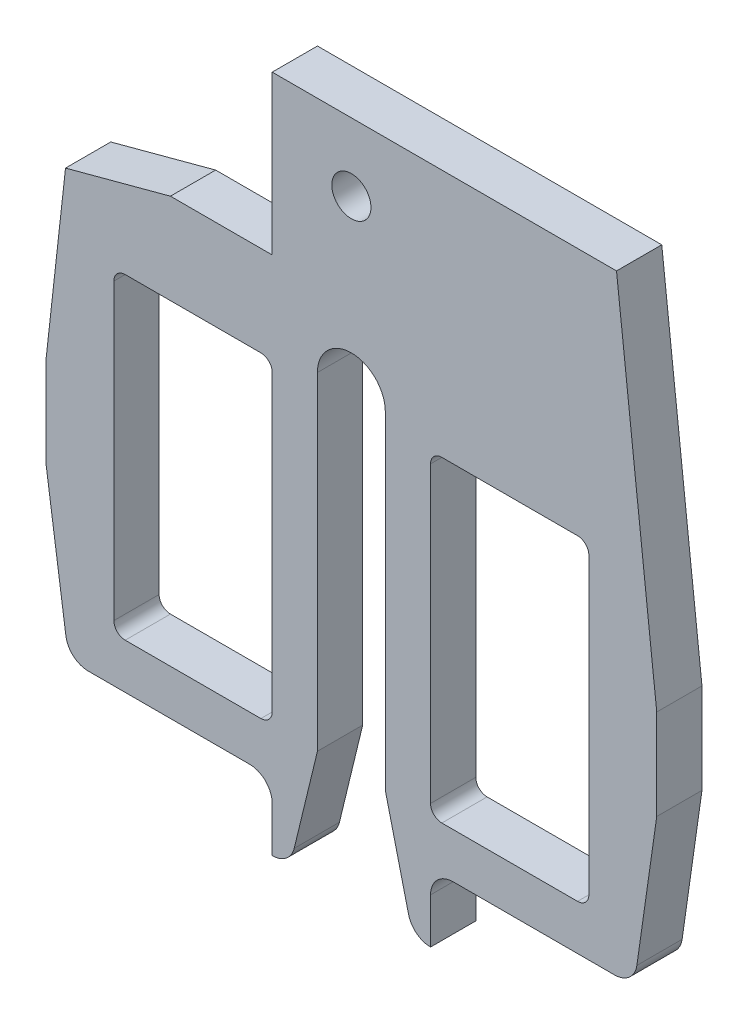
ISO-10303-21;
HEADER;
FILE_DESCRIPTION(('STEP AP214'),'2;1');
FILE_NAME('part.step','',(''),(''),'','','');
FILE_SCHEMA(('AUTOMOTIVE_DESIGN { 1 0 10303 214 1 1 1 1 }'));
ENDSEC;
DATA;
#1=APPLICATION_CONTEXT('core data for automotive mechanical design processes');
#2=APPLICATION_PROTOCOL_DEFINITION('international standard','automotive_design',2000,#1);
#3=PRODUCT_CONTEXT('',#1,'mechanical');
#4=PRODUCT('Part','Part','',(#3));
#5=PRODUCT_RELATED_PRODUCT_CATEGORY('part','',(#4));
#6=PRODUCT_DEFINITION_FORMATION('','',#4);
#7=PRODUCT_DEFINITION_CONTEXT('part definition',#1,'design');
#8=PRODUCT_DEFINITION('design','',#6,#7);
#9=PRODUCT_DEFINITION_SHAPE('','',#8);
#10=(LENGTH_UNIT() NAMED_UNIT(*) SI_UNIT(.MILLI.,.METRE.));
#11=(NAMED_UNIT(*) PLANE_ANGLE_UNIT() SI_UNIT($,.RADIAN.));
#12=(NAMED_UNIT(*) SI_UNIT($,.STERADIAN.) SOLID_ANGLE_UNIT());
#13=UNCERTAINTY_MEASURE_WITH_UNIT(LENGTH_MEASURE(1.E-05),#10,'distance_accuracy_value','');
#14=(GEOMETRIC_REPRESENTATION_CONTEXT(3) GLOBAL_UNCERTAINTY_ASSIGNED_CONTEXT((#13)) GLOBAL_UNIT_ASSIGNED_CONTEXT((#10,
#11,#12)) REPRESENTATION_CONTEXT('',''));
#15=CARTESIAN_POINT('',(0.,0.,0.));
#16=DIRECTION('',(0.,0.,1.));
#17=DIRECTION('',(1.,0.,0.));
#18=AXIS2_PLACEMENT_3D('',#15,#16,#17);
#19=CARTESIAN_POINT('',(-11.6327,-29.0855785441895,0.));
#20=DIRECTION('',(0.,0.,1.));
#21=DIRECTION('',(1.,0.,0.));
#22=AXIS2_PLACEMENT_3D('',#19,#20,#21);
#23=CYLINDRICAL_SURFACE('',#22,0.999999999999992);
#24=CARTESIAN_POINT('',(-11.6327,-29.0855785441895,-1.));
#25=DIRECTION('',(0.,0.,1.));
#26=DIRECTION('',(1.,0.,0.));
#27=AXIS2_PLACEMENT_3D('',#24,#25,#26);
#28=CIRCLE('',#27,0.999999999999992);
#29=CARTESIAN_POINT('',(-12.6226493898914,-29.2270006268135,-1.));
#30=VERTEX_POINT('',#29);
#31=CARTESIAN_POINT('',(-11.6327,-30.0855785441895,-1.));
#32=VERTEX_POINT('',#31);
#33=EDGE_CURVE('E19',#30,#32,#28,.T.);
#34=ORIENTED_EDGE('',*,*,#33,.T.);
#35=DIRECTION('',(0.,0.,-1.));
#36=VECTOR('',#35,1.);
#37=CARTESIAN_POINT('',(-11.6327,-30.0855785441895,0.));
#38=LINE('',#37,#36);
#39=CARTESIAN_POINT('',(-11.6327,-30.0855785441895,1.));
#40=VERTEX_POINT('',#39);
#41=EDGE_CURVE('E267',#40,#32,#38,.T.);
#42=ORIENTED_EDGE('',*,*,#41,.F.);
#43=CARTESIAN_POINT('',(-11.6327,-29.0855785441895,1.));
#44=DIRECTION('',(0.,0.,1.));
#45=DIRECTION('',(1.,0.,0.));
#46=AXIS2_PLACEMENT_3D('',#43,#44,#45);
#47=CIRCLE('',#46,0.999999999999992);
#48=CARTESIAN_POINT('',(-12.6226493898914,-29.2270006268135,1.));
#49=VERTEX_POINT('',#48);
#50=EDGE_CURVE('E263',#49,#40,#47,.T.);
#51=ORIENTED_EDGE('',*,*,#50,.F.);
#52=DIRECTION('',(0.,0.,1.));
#53=VECTOR('',#52,1.);
#54=CARTESIAN_POINT('',(-12.6226493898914,-29.2270006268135,0.));
#55=LINE('',#54,#53);
#56=EDGE_CURVE('E265',#30,#49,#55,.T.);
#57=ORIENTED_EDGE('',*,*,#56,.F.);
#58=EDGE_LOOP('',(#34,#42,#51,#57));
#59=FACE_BOUND('',#58,.T.);
#60=ADVANCED_FACE('F16',(#59),#23,.T.);
#61=CARTESIAN_POINT('',(-4.5,-31.0855785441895,0.));
#62=DIRECTION('',(0.,0.,1.));
#63=DIRECTION('',(1.,0.,0.));
#64=AXIS2_PLACEMENT_3D('',#61,#62,#63);
#65=CYLINDRICAL_SURFACE('',#64,1.00000000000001);
#66=DIRECTION('',(0.,0.,-1.));
#67=VECTOR('',#66,1.);
#68=CARTESIAN_POINT('',(-4.5,-30.0855785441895,0.));
#69=LINE('',#68,#67);
#70=CARTESIAN_POINT('',(-4.5,-30.0855785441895,-1.));
#71=VERTEX_POINT('',#70);
#72=CARTESIAN_POINT('',(-4.5,-30.0855785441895,1.));
#73=VERTEX_POINT('',#72);
#74=EDGE_CURVE('E372',#71,#73,#69,.F.);
#75=ORIENTED_EDGE('',*,*,#74,.F.);
#76=CARTESIAN_POINT('',(-4.5,-31.0855785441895,-1.));
#77=DIRECTION('',(0.,0.,1.));
#78=DIRECTION('',(1.,0.,0.));
#79=AXIS2_PLACEMENT_3D('',#76,#77,#78);
#80=CIRCLE('',#79,1.00000000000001);
#81=CARTESIAN_POINT('',(-3.5,-31.0855785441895,-1.));
#82=VERTEX_POINT('',#81);
#83=EDGE_CURVE('E364',#82,#71,#80,.T.);
#84=ORIENTED_EDGE('',*,*,#83,.F.);
#85=DIRECTION('',(0.,0.,1.));
#86=VECTOR('',#85,1.);
#87=CARTESIAN_POINT('',(-3.5,-31.0855785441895,0.));
#88=LINE('',#87,#86);
#89=CARTESIAN_POINT('',(-3.5,-31.0855785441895,1.));
#90=VERTEX_POINT('',#89);
#91=EDGE_CURVE('E486',#90,#82,#88,.F.);
#92=ORIENTED_EDGE('',*,*,#91,.F.);
#93=CARTESIAN_POINT('',(-4.5,-31.0855785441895,1.));
#94=DIRECTION('',(0.,0.,1.));
#95=DIRECTION('',(1.,0.,0.));
#96=AXIS2_PLACEMENT_3D('',#93,#94,#95);
#97=CIRCLE('',#96,1.00000000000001);
#98=EDGE_CURVE('E272',#73,#90,#97,.F.);
#99=ORIENTED_EDGE('',*,*,#98,.F.);
#100=EDGE_LOOP('',(#75,#84,#92,#99));
#101=FACE_BOUND('',#100,.T.);
#102=ADVANCED_FACE('F565',(#101),#65,.F.);
#103=CARTESIAN_POINT('',(-3.5,-32.0855785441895,0.));
#104=DIRECTION('',(0.,0.,1.));
#105=DIRECTION('',(1.,0.,0.));
#106=AXIS2_PLACEMENT_3D('',#103,#104,#105);
#107=CYLINDRICAL_SURFACE('',#106,1.);
#108=CARTESIAN_POINT('',(-3.5,-32.0855785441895,-1.));
#109=DIRECTION('',(0.,0.,1.));
#110=DIRECTION('',(1.,0.,0.));
#111=AXIS2_PLACEMENT_3D('',#108,#109,#110);
#112=CIRCLE('',#111,1.);
#113=CARTESIAN_POINT('',(-3.5,-33.0855785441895,-1.));
#114=VERTEX_POINT('',#113);
#115=CARTESIAN_POINT('',(-2.52822021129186,-32.3214684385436,-1.));
#116=VERTEX_POINT('',#115);
#117=EDGE_CURVE('E363',#114,#116,#112,.T.);
#118=ORIENTED_EDGE('',*,*,#117,.T.);
#119=DIRECTION('',(0.,0.,1.));
#120=VECTOR('',#119,1.);
#121=CARTESIAN_POINT('',(-2.52822021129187,-32.3214684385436,0.));
#122=LINE('',#121,#120);
#123=CARTESIAN_POINT('',(-2.52822021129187,-32.3214684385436,1.));
#124=VERTEX_POINT('',#123);
#125=EDGE_CURVE('E482',#124,#116,#122,.F.);
#126=ORIENTED_EDGE('',*,*,#125,.F.);
#127=CARTESIAN_POINT('',(-3.5,-32.0855785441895,1.));
#128=DIRECTION('',(0.,0.,1.));
#129=DIRECTION('',(1.,0.,0.));
#130=AXIS2_PLACEMENT_3D('',#127,#128,#129);
#131=CIRCLE('',#130,1.);
#132=CARTESIAN_POINT('',(-3.5,-33.0855785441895,1.));
#133=VERTEX_POINT('',#132);
#134=EDGE_CURVE('E339',#133,#124,#131,.T.);
#135=ORIENTED_EDGE('',*,*,#134,.F.);
#136=DIRECTION('',(0.,0.,1.));
#137=VECTOR('',#136,1.);
#138=CARTESIAN_POINT('',(-3.5,-33.0855785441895,0.));
#139=LINE('',#138,#137);
#140=EDGE_CURVE('E489',#114,#133,#139,.T.);
#141=ORIENTED_EDGE('',*,*,#140,.F.);
#142=EDGE_LOOP('',(#118,#126,#135,#141));
#143=FACE_BOUND('',#142,.T.);
#144=ADVANCED_FACE('F567',(#143),#107,.T.);
#145=CARTESIAN_POINT('',(3.5,-32.0855785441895,0.));
#146=DIRECTION('',(0.,0.,1.));
#147=DIRECTION('',(1.,0.,0.));
#148=AXIS2_PLACEMENT_3D('',#145,#146,#147);
#149=CYLINDRICAL_SURFACE('',#148,1.);
#150=CARTESIAN_POINT('',(3.5,-32.0855785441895,-1.));
#151=DIRECTION('',(0.,0.,1.));
#152=DIRECTION('',(1.,0.,0.));
#153=AXIS2_PLACEMENT_3D('',#150,#151,#152);
#154=CIRCLE('',#153,1.);
#155=CARTESIAN_POINT('',(2.52822021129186,-32.3214684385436,-1.));
#156=VERTEX_POINT('',#155);
#157=CARTESIAN_POINT('',(3.5,-33.0855785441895,-1.));
#158=VERTEX_POINT('',#157);
#159=EDGE_CURVE('E361',#156,#158,#154,.T.);
#160=ORIENTED_EDGE('',*,*,#159,.T.);
#161=DIRECTION('',(0.,0.,-1.));
#162=VECTOR('',#161,1.);
#163=CARTESIAN_POINT('',(3.5,-33.0855785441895,0.));
#164=LINE('',#163,#162);
#165=CARTESIAN_POINT('',(3.5,-33.0855785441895,1.));
#166=VERTEX_POINT('',#165);
#167=EDGE_CURVE('E460',#166,#158,#164,.T.);
#168=ORIENTED_EDGE('',*,*,#167,.F.);
#169=CARTESIAN_POINT('',(3.5,-32.0855785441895,1.));
#170=DIRECTION('',(0.,0.,1.));
#171=DIRECTION('',(1.,0.,0.));
#172=AXIS2_PLACEMENT_3D('',#169,#170,#171);
#173=CIRCLE('',#172,1.);
#174=CARTESIAN_POINT('',(2.52822021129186,-32.3214684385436,1.));
#175=VERTEX_POINT('',#174);
#176=EDGE_CURVE('E337',#175,#166,#173,.T.);
#177=ORIENTED_EDGE('',*,*,#176,.F.);
#178=DIRECTION('',(0.,0.,1.));
#179=VECTOR('',#178,1.);
#180=CARTESIAN_POINT('',(2.52822021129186,-32.3214684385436,0.));
#181=LINE('',#180,#179);
#182=EDGE_CURVE('E467',#156,#175,#181,.T.);
#183=ORIENTED_EDGE('',*,*,#182,.F.);
#184=EDGE_LOOP('',(#160,#168,#177,#183));
#185=FACE_BOUND('',#184,.T.);
#186=ADVANCED_FACE('F573',(#185),#149,.T.);
#187=CARTESIAN_POINT('',(4.5,-31.0855785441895,0.));
#188=DIRECTION('',(0.,0.,1.));
#189=DIRECTION('',(1.,0.,0.));
#190=AXIS2_PLACEMENT_3D('',#187,#188,#189);
#191=CYLINDRICAL_SURFACE('',#190,1.00000000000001);
#192=DIRECTION('',(0.,0.,-1.));
#193=VECTOR('',#192,1.);
#194=CARTESIAN_POINT('',(3.5,-31.0855785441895,0.));
#195=LINE('',#194,#193);
#196=CARTESIAN_POINT('',(3.5,-31.0855785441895,-1.));
#197=VERTEX_POINT('',#196);
#198=CARTESIAN_POINT('',(3.5,-31.0855785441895,1.));
#199=VERTEX_POINT('',#198);
#200=EDGE_CURVE('E463',#197,#199,#195,.F.);
#201=ORIENTED_EDGE('',*,*,#200,.F.);
#202=CARTESIAN_POINT('',(4.5,-31.0855785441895,-1.));
#203=DIRECTION('',(0.,0.,1.));
#204=DIRECTION('',(1.,0.,0.));
#205=AXIS2_PLACEMENT_3D('',#202,#203,#204);
#206=CIRCLE('',#205,1.00000000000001);
#207=CARTESIAN_POINT('',(4.5,-30.0855785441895,-1.));
#208=VERTEX_POINT('',#207);
#209=EDGE_CURVE('E359',#208,#197,#206,.T.);
#210=ORIENTED_EDGE('',*,*,#209,.F.);
#211=DIRECTION('',(0.,0.,-1.));
#212=VECTOR('',#211,1.);
#213=CARTESIAN_POINT('',(4.5,-30.0855785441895,0.));
#214=LINE('',#213,#212);
#215=CARTESIAN_POINT('',(4.5,-30.0855785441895,1.));
#216=VERTEX_POINT('',#215);
#217=EDGE_CURVE('E453',#216,#208,#214,.T.);
#218=ORIENTED_EDGE('',*,*,#217,.F.);
#219=CARTESIAN_POINT('',(4.5,-31.0855785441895,1.));
#220=DIRECTION('',(0.,0.,1.));
#221=DIRECTION('',(1.,0.,0.));
#222=AXIS2_PLACEMENT_3D('',#219,#220,#221);
#223=CIRCLE('',#222,1.00000000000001);
#224=EDGE_CURVE('E335',#199,#216,#223,.F.);
#225=ORIENTED_EDGE('',*,*,#224,.F.);
#226=EDGE_LOOP('',(#201,#210,#218,#225));
#227=FACE_BOUND('',#226,.T.);
#228=ADVANCED_FACE('F727',(#227),#191,.F.);
#229=CARTESIAN_POINT('',(11.6327,-29.0855785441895,0.));
#230=DIRECTION('',(0.,0.,1.));
#231=DIRECTION('',(1.,0.,0.));
#232=AXIS2_PLACEMENT_3D('',#229,#230,#231);
#233=CYLINDRICAL_SURFACE('',#232,0.999999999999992);
#234=CARTESIAN_POINT('',(11.6327,-29.0855785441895,-1.));
#235=DIRECTION('',(0.,0.,1.));
#236=DIRECTION('',(1.,0.,0.));
#237=AXIS2_PLACEMENT_3D('',#234,#235,#236);
#238=CIRCLE('',#237,0.999999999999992);
#239=CARTESIAN_POINT('',(11.6327,-30.0855785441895,-1.));
#240=VERTEX_POINT('',#239);
#241=CARTESIAN_POINT('',(12.6226493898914,-29.2270006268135,-1.));
#242=VERTEX_POINT('',#241);
#243=EDGE_CURVE('E357',#240,#242,#238,.T.);
#244=ORIENTED_EDGE('',*,*,#243,.T.);
#245=DIRECTION('',(0.,0.,1.));
#246=VECTOR('',#245,1.);
#247=CARTESIAN_POINT('',(12.6226493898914,-29.2270006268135,0.));
#248=LINE('',#247,#246);
#249=CARTESIAN_POINT('',(12.6226493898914,-29.2270006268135,1.));
#250=VERTEX_POINT('',#249);
#251=EDGE_CURVE('E439',#250,#242,#248,.F.);
#252=ORIENTED_EDGE('',*,*,#251,.F.);
#253=CARTESIAN_POINT('',(11.6327,-29.0855785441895,1.));
#254=DIRECTION('',(0.,0.,1.));
#255=DIRECTION('',(1.,0.,0.));
#256=AXIS2_PLACEMENT_3D('',#253,#254,#255);
#257=CIRCLE('',#256,0.999999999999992);
#258=CARTESIAN_POINT('',(11.6327,-30.0855785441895,1.));
#259=VERTEX_POINT('',#258);
#260=EDGE_CURVE('E333',#259,#250,#257,.T.);
#261=ORIENTED_EDGE('',*,*,#260,.F.);
#262=DIRECTION('',(0.,0.,-1.));
#263=VECTOR('',#262,1.);
#264=CARTESIAN_POINT('',(11.6327,-30.0855785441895,0.));
#265=LINE('',#264,#263);
#266=EDGE_CURVE('E456',#240,#259,#265,.F.);
#267=ORIENTED_EDGE('',*,*,#266,.F.);
#268=EDGE_LOOP('',(#244,#252,#261,#267));
#269=FACE_BOUND('',#268,.T.);
#270=ADVANCED_FACE('F723',(#269),#233,.T.);
#271=CARTESIAN_POINT('',(4.,-14.5855785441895,0.));
#272=DIRECTION('',(0.,0.,1.));
#273=DIRECTION('',(1.,0.,0.));
#274=AXIS2_PLACEMENT_3D('',#271,#272,#273);
#275=CYLINDRICAL_SURFACE('',#274,0.500000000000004);
#276=DIRECTION('',(0.,0.,1.));
#277=VECTOR('',#276,1.);
#278=CARTESIAN_POINT('',(3.5,-14.5855785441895,0.));
#279=LINE('',#278,#277);
#280=CARTESIAN_POINT('',(3.5,-14.5855785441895,1.));
#281=VERTEX_POINT('',#280);
#282=CARTESIAN_POINT('',(3.5,-14.5855785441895,-1.));
#283=VERTEX_POINT('',#282);
#284=EDGE_CURVE('E435',#281,#283,#279,.F.);
#285=ORIENTED_EDGE('',*,*,#284,.T.);
#286=CARTESIAN_POINT('',(4.,-14.5855785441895,-1.));
#287=DIRECTION('',(0.,0.,1.));
#288=DIRECTION('',(1.,0.,0.));
#289=AXIS2_PLACEMENT_3D('',#286,#287,#288);
#290=CIRCLE('',#289,0.500000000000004);
#291=CARTESIAN_POINT('',(4.,-14.0855785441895,-1.));
#292=VERTEX_POINT('',#291);
#293=EDGE_CURVE('E355',#292,#283,#290,.T.);
#294=ORIENTED_EDGE('',*,*,#293,.F.);
#295=DIRECTION('',(0.,0.,1.));
#296=VECTOR('',#295,1.);
#297=CARTESIAN_POINT('',(4.,-14.0855785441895,0.));
#298=LINE('',#297,#296);
#299=CARTESIAN_POINT('',(4.,-14.0855785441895,1.));
#300=VERTEX_POINT('',#299);
#301=EDGE_CURVE('E425',#292,#300,#298,.T.);
#302=ORIENTED_EDGE('',*,*,#301,.T.);
#303=CARTESIAN_POINT('',(4.,-14.5855785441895,1.));
#304=DIRECTION('',(0.,0.,1.));
#305=DIRECTION('',(1.,0.,0.));
#306=AXIS2_PLACEMENT_3D('',#303,#304,#305);
#307=CIRCLE('',#306,0.500000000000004);
#308=EDGE_CURVE('E329',#281,#300,#307,.F.);
#309=ORIENTED_EDGE('',*,*,#308,.F.);
#310=EDGE_LOOP('',(#285,#294,#302,#309));
#311=FACE_BOUND('',#310,.T.);
#312=ADVANCED_FACE('F719',(#311),#275,.F.);
#313=CARTESIAN_POINT('',(10.,-14.5855785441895,0.));
#314=DIRECTION('',(0.,0.,1.));
#315=DIRECTION('',(1.,0.,0.));
#316=AXIS2_PLACEMENT_3D('',#313,#314,#315);
#317=CYLINDRICAL_SURFACE('',#316,0.500000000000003);
#318=DIRECTION('',(0.,0.,1.));
#319=VECTOR('',#318,1.);
#320=CARTESIAN_POINT('',(10.,-14.0855785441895,0.));
#321=LINE('',#320,#319);
#322=CARTESIAN_POINT('',(10.,-14.0855785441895,1.));
#323=VERTEX_POINT('',#322);
#324=CARTESIAN_POINT('',(10.,-14.0855785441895,-1.));
#325=VERTEX_POINT('',#324);
#326=EDGE_CURVE('E428',#323,#325,#321,.F.);
#327=ORIENTED_EDGE('',*,*,#326,.T.);
#328=CARTESIAN_POINT('',(10.,-14.5855785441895,-1.));
#329=DIRECTION('',(0.,0.,1.));
#330=DIRECTION('',(1.,0.,0.));
#331=AXIS2_PLACEMENT_3D('',#328,#329,#330);
#332=CIRCLE('',#331,0.500000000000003);
#333=CARTESIAN_POINT('',(10.5,-14.5855785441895,-1.));
#334=VERTEX_POINT('',#333);
#335=EDGE_CURVE('E353',#334,#325,#332,.T.);
#336=ORIENTED_EDGE('',*,*,#335,.F.);
#337=DIRECTION('',(0.,0.,-1.));
#338=VECTOR('',#337,1.);
#339=CARTESIAN_POINT('',(10.5,-14.5855785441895,0.));
#340=LINE('',#339,#338);
#341=CARTESIAN_POINT('',(10.5,-14.5855785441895,1.));
#342=VERTEX_POINT('',#341);
#343=EDGE_CURVE('E418',#334,#342,#340,.F.);
#344=ORIENTED_EDGE('',*,*,#343,.T.);
#345=CARTESIAN_POINT('',(10.,-14.5855785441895,1.));
#346=DIRECTION('',(0.,0.,1.));
#347=DIRECTION('',(1.,0.,0.));
#348=AXIS2_PLACEMENT_3D('',#345,#346,#347);
#349=CIRCLE('',#348,0.500000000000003);
#350=EDGE_CURVE('E327',#323,#342,#349,.F.);
#351=ORIENTED_EDGE('',*,*,#350,.F.);
#352=EDGE_LOOP('',(#327,#336,#344,#351));
#353=FACE_BOUND('',#352,.T.);
#354=ADVANCED_FACE('F715',(#353),#317,.F.);
#355=CARTESIAN_POINT('',(4.,-27.5855785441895,0.));
#356=DIRECTION('',(0.,0.,1.));
#357=DIRECTION('',(1.,0.,0.));
#358=AXIS2_PLACEMENT_3D('',#355,#356,#357);
#359=CYLINDRICAL_SURFACE('',#358,0.499999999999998);
#360=DIRECTION('',(0.,0.,-1.));
#361=VECTOR('',#360,1.);
#362=CARTESIAN_POINT('',(4.,-28.0855785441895,0.));
#363=LINE('',#362,#361);
#364=CARTESIAN_POINT('',(4.,-28.0855785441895,1.));
#365=VERTEX_POINT('',#364);
#366=CARTESIAN_POINT('',(4.,-28.0855785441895,-1.));
#367=VERTEX_POINT('',#366);
#368=EDGE_CURVE('E414',#365,#367,#363,.T.);
#369=ORIENTED_EDGE('',*,*,#368,.T.);
#370=CARTESIAN_POINT('',(4.,-27.5855785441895,-1.));
#371=DIRECTION('',(0.,0.,1.));
#372=DIRECTION('',(1.,0.,0.));
#373=AXIS2_PLACEMENT_3D('',#370,#371,#372);
#374=CIRCLE('',#373,0.499999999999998);
#375=CARTESIAN_POINT('',(3.5,-27.5855785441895,-1.));
#376=VERTEX_POINT('',#375);
#377=EDGE_CURVE('E351',#376,#367,#374,.T.);
#378=ORIENTED_EDGE('',*,*,#377,.F.);
#379=DIRECTION('',(0.,0.,1.));
#380=VECTOR('',#379,1.);
#381=CARTESIAN_POINT('',(3.5,-27.5855785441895,0.));
#382=LINE('',#381,#380);
#383=CARTESIAN_POINT('',(3.5,-27.5855785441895,1.));
#384=VERTEX_POINT('',#383);
#385=EDGE_CURVE('E432',#376,#384,#382,.T.);
#386=ORIENTED_EDGE('',*,*,#385,.T.);
#387=CARTESIAN_POINT('',(4.,-27.5855785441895,1.));
#388=DIRECTION('',(0.,0.,1.));
#389=DIRECTION('',(1.,0.,0.));
#390=AXIS2_PLACEMENT_3D('',#387,#388,#389);
#391=CIRCLE('',#390,0.499999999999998);
#392=EDGE_CURVE('E331',#365,#384,#391,.F.);
#393=ORIENTED_EDGE('',*,*,#392,.F.);
#394=EDGE_LOOP('',(#369,#378,#386,#393));
#395=FACE_BOUND('',#394,.T.);
#396=ADVANCED_FACE('F711',(#395),#359,.F.);
#397=CARTESIAN_POINT('',(10.,-27.5855785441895,0.));
#398=DIRECTION('',(0.,0.,1.));
#399=DIRECTION('',(1.,0.,0.));
#400=AXIS2_PLACEMENT_3D('',#397,#398,#399);
#401=CYLINDRICAL_SURFACE('',#400,0.499999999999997);
#402=DIRECTION('',(0.,0.,-1.));
#403=VECTOR('',#402,1.);
#404=CARTESIAN_POINT('',(10.5,-27.5855785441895,0.));
#405=LINE('',#404,#403);
#406=CARTESIAN_POINT('',(10.5,-27.5855785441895,1.));
#407=VERTEX_POINT('',#406);
#408=CARTESIAN_POINT('',(10.5,-27.5855785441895,-1.));
#409=VERTEX_POINT('',#408);
#410=EDGE_CURVE('E421',#407,#409,#405,.T.);
#411=ORIENTED_EDGE('',*,*,#410,.T.);
#412=CARTESIAN_POINT('',(10.,-27.5855785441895,-1.));
#413=DIRECTION('',(0.,0.,1.));
#414=DIRECTION('',(1.,0.,0.));
#415=AXIS2_PLACEMENT_3D('',#412,#413,#414);
#416=CIRCLE('',#415,0.499999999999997);
#417=CARTESIAN_POINT('',(10.,-28.0855785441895,-1.));
#418=VERTEX_POINT('',#417);
#419=EDGE_CURVE('E349',#418,#409,#416,.T.);
#420=ORIENTED_EDGE('',*,*,#419,.F.);
#421=DIRECTION('',(0.,0.,-1.));
#422=VECTOR('',#421,1.);
#423=CARTESIAN_POINT('',(10.,-28.0855785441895,0.));
#424=LINE('',#423,#422);
#425=CARTESIAN_POINT('',(10.,-28.0855785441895,1.));
#426=VERTEX_POINT('',#425);
#427=EDGE_CURVE('E411',#418,#426,#424,.F.);
#428=ORIENTED_EDGE('',*,*,#427,.T.);
#429=CARTESIAN_POINT('',(10.,-27.5855785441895,1.));
#430=DIRECTION('',(0.,0.,1.));
#431=DIRECTION('',(1.,0.,0.));
#432=AXIS2_PLACEMENT_3D('',#429,#430,#431);
#433=CIRCLE('',#432,0.499999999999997);
#434=EDGE_CURVE('E325',#407,#426,#433,.F.);
#435=ORIENTED_EDGE('',*,*,#434,.F.);
#436=EDGE_LOOP('',(#411,#420,#428,#435));
#437=FACE_BOUND('',#436,.T.);
#438=ADVANCED_FACE('F707',(#437),#401,.F.);
#439=CARTESIAN_POINT('',(-4.,-27.5855785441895,0.));
#440=DIRECTION('',(0.,0.,1.));
#441=DIRECTION('',(1.,0.,0.));
#442=AXIS2_PLACEMENT_3D('',#439,#440,#441);
#443=CYLINDRICAL_SURFACE('',#442,0.499999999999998);
#444=DIRECTION('',(0.,0.,-1.));
#445=VECTOR('',#444,1.);
#446=CARTESIAN_POINT('',(-3.5,-27.5855785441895,0.));
#447=LINE('',#446,#445);
#448=CARTESIAN_POINT('',(-3.5,-27.5855785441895,1.));
#449=VERTEX_POINT('',#448);
#450=CARTESIAN_POINT('',(-3.5,-27.5855785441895,-1.));
#451=VERTEX_POINT('',#450);
#452=EDGE_CURVE('E407',#449,#451,#447,.T.);
#453=ORIENTED_EDGE('',*,*,#452,.T.);
#454=CARTESIAN_POINT('',(-4.,-27.5855785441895,-1.));
#455=DIRECTION('',(0.,0.,1.));
#456=DIRECTION('',(1.,0.,0.));
#457=AXIS2_PLACEMENT_3D('',#454,#455,#456);
#458=CIRCLE('',#457,0.499999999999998);
#459=CARTESIAN_POINT('',(-4.,-28.0855785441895,-1.));
#460=VERTEX_POINT('',#459);
#461=EDGE_CURVE('E347',#460,#451,#458,.T.);
#462=ORIENTED_EDGE('',*,*,#461,.F.);
#463=DIRECTION('',(0.,0.,-1.));
#464=VECTOR('',#463,1.);
#465=CARTESIAN_POINT('',(-4.,-28.0855785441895,0.));
#466=LINE('',#465,#464);
#467=CARTESIAN_POINT('',(-4.,-28.0855785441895,1.));
#468=VERTEX_POINT('',#467);
#469=EDGE_CURVE('E397',#460,#468,#466,.F.);
#470=ORIENTED_EDGE('',*,*,#469,.T.);
#471=CARTESIAN_POINT('',(-4.,-27.5855785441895,1.));
#472=DIRECTION('',(0.,0.,1.));
#473=DIRECTION('',(1.,0.,0.));
#474=AXIS2_PLACEMENT_3D('',#471,#472,#473);
#475=CIRCLE('',#474,0.499999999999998);
#476=EDGE_CURVE('E321',#449,#468,#475,.F.);
#477=ORIENTED_EDGE('',*,*,#476,.F.);
#478=EDGE_LOOP('',(#453,#462,#470,#477));
#479=FACE_BOUND('',#478,.T.);
#480=ADVANCED_FACE('F703',(#479),#443,.F.);
#481=CARTESIAN_POINT('',(-10.,-27.5855785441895,0.));
#482=DIRECTION('',(0.,0.,1.));
#483=DIRECTION('',(1.,0.,0.));
#484=AXIS2_PLACEMENT_3D('',#481,#482,#483);
#485=CYLINDRICAL_SURFACE('',#484,0.499999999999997);
#486=DIRECTION('',(0.,0.,-1.));
#487=VECTOR('',#486,1.);
#488=CARTESIAN_POINT('',(-10.,-28.0855785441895,0.));
#489=LINE('',#488,#487);
#490=CARTESIAN_POINT('',(-10.,-28.0855785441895,1.));
#491=VERTEX_POINT('',#490);
#492=CARTESIAN_POINT('',(-10.,-28.0855785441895,-1.));
#493=VERTEX_POINT('',#492);
#494=EDGE_CURVE('E400',#491,#493,#489,.T.);
#495=ORIENTED_EDGE('',*,*,#494,.T.);
#496=CARTESIAN_POINT('',(-10.,-27.5855785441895,-1.));
#497=DIRECTION('',(0.,0.,1.));
#498=DIRECTION('',(1.,0.,0.));
#499=AXIS2_PLACEMENT_3D('',#496,#497,#498);
#500=CIRCLE('',#499,0.499999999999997);
#501=CARTESIAN_POINT('',(-10.5,-27.5855785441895,-1.));
#502=VERTEX_POINT('',#501);
#503=EDGE_CURVE('E345',#502,#493,#500,.T.);
#504=ORIENTED_EDGE('',*,*,#503,.F.);
#505=DIRECTION('',(0.,0.,1.));
#506=VECTOR('',#505,1.);
#507=CARTESIAN_POINT('',(-10.5,-27.5855785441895,0.));
#508=LINE('',#507,#506);
#509=CARTESIAN_POINT('',(-10.5,-27.5855785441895,1.));
#510=VERTEX_POINT('',#509);
#511=EDGE_CURVE('E391',#502,#510,#508,.T.);
#512=ORIENTED_EDGE('',*,*,#511,.T.);
#513=CARTESIAN_POINT('',(-10.,-27.5855785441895,1.));
#514=DIRECTION('',(0.,0.,1.));
#515=DIRECTION('',(1.,0.,0.));
#516=AXIS2_PLACEMENT_3D('',#513,#514,#515);
#517=CIRCLE('',#516,0.499999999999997);
#518=EDGE_CURVE('E319',#491,#510,#517,.F.);
#519=ORIENTED_EDGE('',*,*,#518,.F.);
#520=EDGE_LOOP('',(#495,#504,#512,#519));
#521=FACE_BOUND('',#520,.T.);
#522=ADVANCED_FACE('F699',(#521),#485,.F.);
#523=CARTESIAN_POINT('',(-4.,-14.5855785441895,0.));
#524=DIRECTION('',(0.,0.,1.));
#525=DIRECTION('',(1.,0.,0.));
#526=AXIS2_PLACEMENT_3D('',#523,#524,#525);
#527=CYLINDRICAL_SURFACE('',#526,0.500000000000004);
#528=DIRECTION('',(0.,0.,1.));
#529=VECTOR('',#528,1.);
#530=CARTESIAN_POINT('',(-4.,-14.0855785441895,0.));
#531=LINE('',#530,#529);
#532=CARTESIAN_POINT('',(-4.,-14.0855785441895,1.));
#533=VERTEX_POINT('',#532);
#534=CARTESIAN_POINT('',(-4.,-14.0855785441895,-1.));
#535=VERTEX_POINT('',#534);
#536=EDGE_CURVE('E387',#533,#535,#531,.F.);
#537=ORIENTED_EDGE('',*,*,#536,.T.);
#538=CARTESIAN_POINT('',(-4.,-14.5855785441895,-1.));
#539=DIRECTION('',(0.,0.,1.));
#540=DIRECTION('',(1.,0.,0.));
#541=AXIS2_PLACEMENT_3D('',#538,#539,#540);
#542=CIRCLE('',#541,0.500000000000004);
#543=CARTESIAN_POINT('',(-3.5,-14.5855785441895,-1.));
#544=VERTEX_POINT('',#543);
#545=EDGE_CURVE('E343',#544,#535,#542,.T.);
#546=ORIENTED_EDGE('',*,*,#545,.F.);
#547=DIRECTION('',(0.,0.,-1.));
#548=VECTOR('',#547,1.);
#549=CARTESIAN_POINT('',(-3.5,-14.5855785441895,0.));
#550=LINE('',#549,#548);
#551=CARTESIAN_POINT('',(-3.5,-14.5855785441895,1.));
#552=VERTEX_POINT('',#551);
#553=EDGE_CURVE('E404',#544,#552,#550,.F.);
#554=ORIENTED_EDGE('',*,*,#553,.T.);
#555=CARTESIAN_POINT('',(-4.,-14.5855785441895,1.));
#556=DIRECTION('',(0.,0.,1.));
#557=DIRECTION('',(1.,0.,0.));
#558=AXIS2_PLACEMENT_3D('',#555,#556,#557);
#559=CIRCLE('',#558,0.500000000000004);
#560=EDGE_CURVE('E323',#533,#552,#559,.F.);
#561=ORIENTED_EDGE('',*,*,#560,.F.);
#562=EDGE_LOOP('',(#537,#546,#554,#561));
#563=FACE_BOUND('',#562,.T.);
#564=ADVANCED_FACE('F696',(#563),#527,.F.);
#565=CARTESIAN_POINT('',(-10.,-14.5855785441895,0.));
#566=DIRECTION('',(0.,0.,1.));
#567=DIRECTION('',(1.,0.,0.));
#568=AXIS2_PLACEMENT_3D('',#565,#566,#567);
#569=CYLINDRICAL_SURFACE('',#568,0.500000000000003);
#570=DIRECTION('',(0.,0.,1.));
#571=VECTOR('',#570,1.);
#572=CARTESIAN_POINT('',(-10.5,-14.5855785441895,0.));
#573=LINE('',#572,#571);
#574=CARTESIAN_POINT('',(-10.5,-14.5855785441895,1.));
#575=VERTEX_POINT('',#574);
#576=CARTESIAN_POINT('',(-10.5,-14.5855785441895,-1.));
#577=VERTEX_POINT('',#576);
#578=EDGE_CURVE('E394',#575,#577,#573,.F.);
#579=ORIENTED_EDGE('',*,*,#578,.T.);
#580=CARTESIAN_POINT('',(-10.,-14.5855785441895,-1.));
#581=DIRECTION('',(0.,0.,1.));
#582=DIRECTION('',(1.,0.,0.));
#583=AXIS2_PLACEMENT_3D('',#580,#581,#582);
#584=CIRCLE('',#583,0.500000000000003);
#585=CARTESIAN_POINT('',(-10.,-14.0855785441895,-1.));
#586=VERTEX_POINT('',#585);
#587=EDGE_CURVE('E34',#586,#577,#584,.T.);
#588=ORIENTED_EDGE('',*,*,#587,.F.);
#589=DIRECTION('',(0.,0.,1.));
#590=VECTOR('',#589,1.);
#591=CARTESIAN_POINT('',(-10.,-14.0855785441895,0.));
#592=LINE('',#591,#590);
#593=CARTESIAN_POINT('',(-10.,-14.0855785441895,1.));
#594=VERTEX_POINT('',#593);
#595=EDGE_CURVE('E385',#586,#594,#592,.T.);
#596=ORIENTED_EDGE('',*,*,#595,.T.);
#597=CARTESIAN_POINT('',(-10.,-14.5855785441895,1.));
#598=DIRECTION('',(0.,0.,1.));
#599=DIRECTION('',(1.,0.,0.));
#600=AXIS2_PLACEMENT_3D('',#597,#598,#599);
#601=CIRCLE('',#600,0.500000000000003);
#602=EDGE_CURVE('E317',#575,#594,#601,.F.);
#603=ORIENTED_EDGE('',*,*,#602,.F.);
#604=EDGE_LOOP('',(#579,#588,#596,#603));
#605=FACE_BOUND('',#604,.T.);
#606=ADVANCED_FACE('F692',(#605),#569,.F.);
#607=CARTESIAN_POINT('',(0.438529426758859,-18.826128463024,1.));
#608=DIRECTION('',(0.,0.,1.));
#609=DIRECTION('',(1.,0.,0.));
#610=AXIS2_PLACEMENT_3D('',#607,#608,#609);
#611=PLANE('',#610);
#612=CARTESIAN_POINT('',(0.,-6.08557854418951,1.));
#613=DIRECTION('',(0.,0.,1.));
#614=DIRECTION('',(1.,0.,0.));
#615=AXIS2_PLACEMENT_3D('',#612,#613,#614);
#616=CIRCLE('',#615,0.865228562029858);
#617=CARTESIAN_POINT('',(0.865228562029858,-6.08557854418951,1.));
#618=VERTEX_POINT('',#617);
#619=EDGE_CURVE('E307',#618,#618,#616,.F.);
#620=ORIENTED_EDGE('',*,*,#619,.T.);
#621=EDGE_LOOP('',(#620));
#622=FACE_BOUND('',#621,.T.);
#623=DIRECTION('',(0.,1.,0.));
#624=VECTOR('',#623,1.);
#625=CARTESIAN_POINT('',(-10.5,-27.5855785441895,1.));
#626=LINE('',#625,#624);
#627=EDGE_CURVE('E390',#510,#575,#626,.T.);
#628=ORIENTED_EDGE('',*,*,#627,.T.);
#629=ORIENTED_EDGE('',*,*,#602,.T.);
#630=DIRECTION('',(1.,0.,0.));
#631=VECTOR('',#630,1.);
#632=CARTESIAN_POINT('',(-10.,-14.0855785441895,1.));
#633=LINE('',#632,#631);
#634=EDGE_CURVE('E311',#594,#533,#633,.T.);
#635=ORIENTED_EDGE('',*,*,#634,.T.);
#636=ORIENTED_EDGE('',*,*,#560,.T.);
#637=DIRECTION('',(0.,1.,0.));
#638=VECTOR('',#637,1.);
#639=CARTESIAN_POINT('',(-3.5,-14.5855785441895,1.));
#640=LINE('',#639,#638);
#641=EDGE_CURVE('E403',#552,#449,#640,.F.);
#642=ORIENTED_EDGE('',*,*,#641,.T.);
#643=ORIENTED_EDGE('',*,*,#476,.T.);
#644=DIRECTION('',(1.,0.,0.));
#645=VECTOR('',#644,1.);
#646=CARTESIAN_POINT('',(-4.,-28.0855785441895,1.));
#647=LINE('',#646,#645);
#648=EDGE_CURVE('E396',#468,#491,#647,.F.);
#649=ORIENTED_EDGE('',*,*,#648,.T.);
#650=ORIENTED_EDGE('',*,*,#518,.T.);
#651=EDGE_LOOP('',(#628,#629,#635,#636,#642,#643,#649,#650));
#652=FACE_BOUND('',#651,.T.);
#653=DIRECTION('',(0.,1.,0.));
#654=VECTOR('',#653,1.);
#655=CARTESIAN_POINT('',(10.5,-14.5855785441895,1.));
#656=LINE('',#655,#654);
#657=EDGE_CURVE('E417',#342,#407,#656,.F.);
#658=ORIENTED_EDGE('',*,*,#657,.T.);
#659=ORIENTED_EDGE('',*,*,#434,.T.);
#660=DIRECTION('',(1.,0.,0.));
#661=VECTOR('',#660,1.);
#662=CARTESIAN_POINT('',(10.,-28.0855785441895,1.));
#663=LINE('',#662,#661);
#664=EDGE_CURVE('E410',#426,#365,#663,.F.);
#665=ORIENTED_EDGE('',*,*,#664,.T.);
#666=ORIENTED_EDGE('',*,*,#392,.T.);
#667=DIRECTION('',(0.,1.,0.));
#668=VECTOR('',#667,1.);
#669=CARTESIAN_POINT('',(3.5,-27.5855785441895,1.));
#670=LINE('',#669,#668);
#671=EDGE_CURVE('E431',#384,#281,#670,.T.);
#672=ORIENTED_EDGE('',*,*,#671,.T.);
#673=ORIENTED_EDGE('',*,*,#308,.T.);
#674=DIRECTION('',(1.,0.,0.));
#675=VECTOR('',#674,1.);
#676=CARTESIAN_POINT('',(4.,-14.0855785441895,1.));
#677=LINE('',#676,#675);
#678=EDGE_CURVE('E424',#300,#323,#677,.T.);
#679=ORIENTED_EDGE('',*,*,#678,.T.);
#680=ORIENTED_EDGE('',*,*,#350,.T.);
#681=EDGE_LOOP('',(#658,#659,#665,#666,#672,#673,#679,#680));
#682=FACE_BOUND('',#681,.T.);
#683=DIRECTION('',(0.141422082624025,0.989949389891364,0.));
#684=VECTOR('',#683,1.);
#685=CARTESIAN_POINT('',(13.5,-23.0855785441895,1.));
#686=LINE('',#685,#684);
#687=CARTESIAN_POINT('',(13.5,-23.0855785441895,1.));
#688=VERTEX_POINT('',#687);
#689=EDGE_CURVE('E443',#688,#250,#686,.F.);
#690=ORIENTED_EDGE('',*,*,#689,.F.);
#691=DIRECTION('',(0.,1.,0.));
#692=VECTOR('',#691,1.);
#693=CARTESIAN_POINT('',(13.5,-19.0855785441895,1.));
#694=LINE('',#693,#692);
#695=CARTESIAN_POINT('',(13.5,-19.0855785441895,1.));
#696=VERTEX_POINT('',#695);
#697=EDGE_CURVE('E442',#696,#688,#694,.F.);
#698=ORIENTED_EDGE('',*,*,#697,.F.);
#699=DIRECTION('',(-0.110431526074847,0.993883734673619,0.));
#700=VECTOR('',#699,1.);
#701=CARTESIAN_POINT('',(12.5,-10.0855785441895,1.));
#702=LINE('',#701,#700);
#703=CARTESIAN_POINT('',(11.7222222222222,-3.08557854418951,1.));
#704=VERTEX_POINT('',#703);
#705=EDGE_CURVE('E452',#704,#696,#702,.F.);
#706=ORIENTED_EDGE('',*,*,#705,.F.);
#707=DIRECTION('',(1.,0.,0.));
#708=VECTOR('',#707,1.);
#709=CARTESIAN_POINT('',(-3.5,-3.08557854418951,1.));
#710=LINE('',#709,#708);
#711=CARTESIAN_POINT('',(-3.5,-3.08557854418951,1.));
#712=VERTEX_POINT('',#711);
#713=EDGE_CURVE('E534',#712,#704,#710,.T.);
#714=ORIENTED_EDGE('',*,*,#713,.F.);
#715=DIRECTION('',(0.,1.,0.));
#716=VECTOR('',#715,1.);
#717=CARTESIAN_POINT('',(-3.5,-10.0855785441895,1.));
#718=LINE('',#717,#716);
#719=CARTESIAN_POINT('',(-3.5,-10.0855785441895,1.));
#720=VERTEX_POINT('',#719);
#721=EDGE_CURVE('E300',#720,#712,#718,.T.);
#722=ORIENTED_EDGE('',*,*,#721,.F.);
#723=DIRECTION('',(1.,0.,0.));
#724=VECTOR('',#723,1.);
#725=CARTESIAN_POINT('',(-8.,-10.0855785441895,1.));
#726=LINE('',#725,#724);
#727=CARTESIAN_POINT('',(-8.,-10.0855785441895,1.));
#728=VERTEX_POINT('',#727);
#729=EDGE_CURVE('E299',#728,#720,#726,.T.);
#730=ORIENTED_EDGE('',*,*,#729,.F.);
#731=DIRECTION('',(-0.965925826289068,-0.258819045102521,0.));
#732=VECTOR('',#731,1.);
#733=CARTESIAN_POINT('',(-12.6380857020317,-11.3283498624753,1.));
#734=LINE('',#733,#732);
#735=CARTESIAN_POINT('',(-12.6380857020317,-11.3283498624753,1.));
#736=VERTEX_POINT('',#735);
#737=EDGE_CURVE('E296',#736,#728,#734,.F.);
#738=ORIENTED_EDGE('',*,*,#737,.F.);
#739=DIRECTION('',(-0.110431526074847,-0.993883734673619,0.));
#740=VECTOR('',#739,1.);
#741=CARTESIAN_POINT('',(-13.5,-19.0855785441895,1.));
#742=LINE('',#741,#740);
#743=CARTESIAN_POINT('',(-13.5,-19.0855785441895,1.));
#744=VERTEX_POINT('',#743);
#745=EDGE_CURVE('E293',#744,#736,#742,.F.);
#746=ORIENTED_EDGE('',*,*,#745,.F.);
#747=DIRECTION('',(0.,1.,0.));
#748=VECTOR('',#747,1.);
#749=CARTESIAN_POINT('',(-13.5,-23.0855785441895,1.));
#750=LINE('',#749,#748);
#751=CARTESIAN_POINT('',(-13.5,-23.0855785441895,1.));
#752=VERTEX_POINT('',#751);
#753=EDGE_CURVE('E283',#752,#744,#750,.T.);
#754=ORIENTED_EDGE('',*,*,#753,.F.);
#755=DIRECTION('',(0.141422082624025,-0.989949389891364,0.));
#756=VECTOR('',#755,1.);
#757=CARTESIAN_POINT('',(-12.6226493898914,-29.2270006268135,1.));
#758=LINE('',#757,#756);
#759=EDGE_CURVE('E275',#49,#752,#758,.F.);
#760=ORIENTED_EDGE('',*,*,#759,.F.);
#761=ORIENTED_EDGE('',*,*,#50,.T.);
#762=DIRECTION('',(1.,0.,0.));
#763=VECTOR('',#762,1.);
#764=CARTESIAN_POINT('',(-4.5,-30.0855785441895,1.));
#765=LINE('',#764,#763);
#766=EDGE_CURVE('E278',#73,#40,#765,.F.);
#767=ORIENTED_EDGE('',*,*,#766,.F.);
#768=ORIENTED_EDGE('',*,*,#98,.T.);
#769=DIRECTION('',(0.,1.,0.));
#770=VECTOR('',#769,1.);
#771=CARTESIAN_POINT('',(-3.5,-33.0855785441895,1.));
#772=LINE('',#771,#770);
#773=EDGE_CURVE('E490',#133,#90,#772,.T.);
#774=ORIENTED_EDGE('',*,*,#773,.F.);
#775=ORIENTED_EDGE('',*,*,#134,.T.);
#776=DIRECTION('',(0.235889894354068,0.971779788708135,0.));
#777=VECTOR('',#776,1.);
#778=CARTESIAN_POINT('',(-1.5,-28.0855785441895,1.));
#779=LINE('',#778,#777);
#780=CARTESIAN_POINT('',(-1.5,-28.0855785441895,1.));
#781=VERTEX_POINT('',#780);
#782=EDGE_CURVE('E485',#781,#124,#779,.F.);
#783=ORIENTED_EDGE('',*,*,#782,.F.);
#784=DIRECTION('',(0.,1.,0.));
#785=VECTOR('',#784,1.);
#786=CARTESIAN_POINT('',(-1.5,-13.5855785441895,1.));
#787=LINE('',#786,#785);
#788=CARTESIAN_POINT('',(-1.5,-13.5855785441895,1.));
#789=VERTEX_POINT('',#788);
#790=EDGE_CURVE('E481',#789,#781,#787,.F.);
#791=ORIENTED_EDGE('',*,*,#790,.F.);
#792=CARTESIAN_POINT('',(0.,-13.5855785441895,1.));
#793=DIRECTION('',(0.,0.,1.));
#794=DIRECTION('',(1.,0.,0.));
#795=AXIS2_PLACEMENT_3D('',#792,#793,#794);
#796=CIRCLE('',#795,1.5);
#797=CARTESIAN_POINT('',(1.5,-13.5855785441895,1.));
#798=VERTEX_POINT('',#797);
#799=EDGE_CURVE('E312',#789,#798,#796,.F.);
#800=ORIENTED_EDGE('',*,*,#799,.T.);
#801=DIRECTION('',(0.,1.,0.));
#802=VECTOR('',#801,1.);
#803=CARTESIAN_POINT('',(1.5,-28.0855785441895,1.));
#804=LINE('',#803,#802);
#805=CARTESIAN_POINT('',(1.49999999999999,-28.0855785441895,1.));
#806=VERTEX_POINT('',#805);
#807=EDGE_CURVE('E315',#806,#798,#804,.T.);
#808=ORIENTED_EDGE('',*,*,#807,.F.);
#809=DIRECTION('',(0.235889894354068,-0.971779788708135,0.));
#810=VECTOR('',#809,1.);
#811=CARTESIAN_POINT('',(2.52822021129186,-32.3214684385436,1.));
#812=LINE('',#811,#810);
#813=EDGE_CURVE('E473',#175,#806,#812,.F.);
#814=ORIENTED_EDGE('',*,*,#813,.F.);
#815=ORIENTED_EDGE('',*,*,#176,.T.);
#816=DIRECTION('',(0.,1.,0.));
#817=VECTOR('',#816,1.);
#818=CARTESIAN_POINT('',(3.5,-31.0855785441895,1.));
#819=LINE('',#818,#817);
#820=EDGE_CURVE('E464',#199,#166,#819,.F.);
#821=ORIENTED_EDGE('',*,*,#820,.F.);
#822=ORIENTED_EDGE('',*,*,#224,.T.);
#823=DIRECTION('',(1.,0.,0.));
#824=VECTOR('',#823,1.);
#825=CARTESIAN_POINT('',(11.6327,-30.0855785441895,1.));
#826=LINE('',#825,#824);
#827=EDGE_CURVE('E457',#259,#216,#826,.F.);
#828=ORIENTED_EDGE('',*,*,#827,.F.);
#829=ORIENTED_EDGE('',*,*,#260,.T.);
#830=EDGE_LOOP('',(#690,#698,#706,#714,#722,#730,#738,#746,#754,#760,#761,#767,#768,#774,#775,
#783,#791,#800,#808,#814,#815,#821,#822,#828,#829));
#831=FACE_BOUND('',#830,.T.);
#832=ADVANCED_FACE('F281',(#622,#652,#682,#831),#611,.T.);
#833=CARTESIAN_POINT('',(-3.5,-10.0855785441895,0.));
#834=DIRECTION('',(-1.,0.,0.));
#835=DIRECTION('',(0.,0.,1.));
#836=AXIS2_PLACEMENT_3D('',#833,#834,#835);
#837=PLANE('',#836);
#838=DIRECTION('',(0.,1.,0.));
#839=VECTOR('',#838,1.);
#840=CARTESIAN_POINT('',(-3.5,-18.826128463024,-1.));
#841=LINE('',#840,#839);
#842=CARTESIAN_POINT('',(-3.5,-3.08557854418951,-1.));
#843=VERTEX_POINT('',#842);
#844=CARTESIAN_POINT('',(-3.5,-10.0855785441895,-1.));
#845=VERTEX_POINT('',#844);
#846=EDGE_CURVE('E310',#843,#845,#841,.F.);
#847=ORIENTED_EDGE('',*,*,#846,.T.);
#848=DIRECTION('',(0.,0.,1.));
#849=VECTOR('',#848,1.);
#850=CARTESIAN_POINT('',(-3.5,-10.0855785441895,0.));
#851=LINE('',#850,#849);
#852=EDGE_CURVE('E298',#720,#845,#851,.F.);
#853=ORIENTED_EDGE('',*,*,#852,.F.);
#854=ORIENTED_EDGE('',*,*,#721,.T.);
#855=DIRECTION('',(0.,0.,1.));
#856=VECTOR('',#855,1.);
#857=CARTESIAN_POINT('',(-3.5,-3.08557854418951,0.));
#858=LINE('',#857,#856);
#859=EDGE_CURVE('E438',#843,#712,#858,.T.);
#860=ORIENTED_EDGE('',*,*,#859,.F.);
#861=EDGE_LOOP('',(#847,#853,#854,#860));
#862=FACE_BOUND('',#861,.T.);
#863=ADVANCED_FACE('F685',(#862),#837,.T.);
#864=CARTESIAN_POINT('',(-8.,-10.0855785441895,0.));
#865=DIRECTION('',(0.,1.,0.));
#866=DIRECTION('',(0.,0.,1.));
#867=AXIS2_PLACEMENT_3D('',#864,#865,#866);
#868=PLANE('',#867);
#869=DIRECTION('',(1.,0.,0.));
#870=VECTOR('',#869,1.);
#871=CARTESIAN_POINT('',(0.438529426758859,-10.0855785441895,-1.));
#872=LINE('',#871,#870);
#873=CARTESIAN_POINT('',(-8.,-10.0855785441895,-1.));
#874=VERTEX_POINT('',#873);
#875=EDGE_CURVE('E503',#845,#874,#872,.F.);
#876=ORIENTED_EDGE('',*,*,#875,.T.);
#877=DIRECTION('',(0.,0.,1.));
#878=VECTOR('',#877,1.);
#879=CARTESIAN_POINT('',(-8.,-10.0855785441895,0.));
#880=LINE('',#879,#878);
#881=EDGE_CURVE('E295',#728,#874,#880,.F.);
#882=ORIENTED_EDGE('',*,*,#881,.F.);
#883=ORIENTED_EDGE('',*,*,#729,.T.);
#884=ORIENTED_EDGE('',*,*,#852,.T.);
#885=EDGE_LOOP('',(#876,#882,#883,#884));
#886=FACE_BOUND('',#885,.T.);
#887=ADVANCED_FACE('F681',(#886),#868,.T.);
#888=CARTESIAN_POINT('',(-12.6380857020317,-11.3283498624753,0.));
#889=DIRECTION('',(-0.258819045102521,0.965925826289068,0.));
#890=DIRECTION('',(-0.965925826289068,-0.258819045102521,0.));
#891=AXIS2_PLACEMENT_3D('',#888,#889,#890);
#892=PLANE('',#891);
#893=DIRECTION('',(-0.965925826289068,-0.258819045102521,0.));
#894=VECTOR('',#893,1.);
#895=CARTESIAN_POINT('',(-8.,-10.0855785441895,-1.));
#896=LINE('',#895,#894);
#897=CARTESIAN_POINT('',(-12.6380857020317,-11.3283498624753,-1.));
#898=VERTEX_POINT('',#897);
#899=EDGE_CURVE('E499',#874,#898,#896,.T.);
#900=ORIENTED_EDGE('',*,*,#899,.T.);
#901=DIRECTION('',(0.,0.,1.));
#902=VECTOR('',#901,1.);
#903=CARTESIAN_POINT('',(-12.6380857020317,-11.3283498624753,0.));
#904=LINE('',#903,#902);
#905=EDGE_CURVE('E292',#736,#898,#904,.F.);
#906=ORIENTED_EDGE('',*,*,#905,.F.);
#907=ORIENTED_EDGE('',*,*,#737,.T.);
#908=ORIENTED_EDGE('',*,*,#881,.T.);
#909=EDGE_LOOP('',(#900,#906,#907,#908));
#910=FACE_BOUND('',#909,.T.);
#911=ADVANCED_FACE('F677',(#910),#892,.T.);
#912=CARTESIAN_POINT('',(-13.5,-19.0855785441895,0.));
#913=DIRECTION('',(-0.993883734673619,0.110431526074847,0.));
#914=DIRECTION('',(-0.110431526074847,-0.993883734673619,0.));
#915=AXIS2_PLACEMENT_3D('',#912,#913,#914);
#916=PLANE('',#915);
#917=DIRECTION('',(-0.110431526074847,-0.993883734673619,0.));
#918=VECTOR('',#917,1.);
#919=CARTESIAN_POINT('',(-12.6380857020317,-11.3283498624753,-1.));
#920=LINE('',#919,#918);
#921=CARTESIAN_POINT('',(-13.5,-19.0855785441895,-1.));
#922=VERTEX_POINT('',#921);
#923=EDGE_CURVE('E495',#898,#922,#920,.T.);
#924=ORIENTED_EDGE('',*,*,#923,.T.);
#925=DIRECTION('',(0.,0.,1.));
#926=VECTOR('',#925,1.);
#927=CARTESIAN_POINT('',(-13.5,-19.0855785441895,0.));
#928=LINE('',#927,#926);
#929=EDGE_CURVE('E284',#744,#922,#928,.F.);
#930=ORIENTED_EDGE('',*,*,#929,.F.);
#931=ORIENTED_EDGE('',*,*,#745,.T.);
#932=ORIENTED_EDGE('',*,*,#905,.T.);
#933=EDGE_LOOP('',(#924,#930,#931,#932));
#934=FACE_BOUND('',#933,.T.);
#935=ADVANCED_FACE('F673',(#934),#916,.T.);
#936=CARTESIAN_POINT('',(-13.5,-23.0855785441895,0.));
#937=DIRECTION('',(-1.,0.,0.));
#938=DIRECTION('',(0.,0.,1.));
#939=AXIS2_PLACEMENT_3D('',#936,#937,#938);
#940=PLANE('',#939);
#941=DIRECTION('',(0.,1.,0.));
#942=VECTOR('',#941,1.);
#943=CARTESIAN_POINT('',(-13.5,-18.826128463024,-1.));
#944=LINE('',#943,#942);
#945=CARTESIAN_POINT('',(-13.5,-23.0855785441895,-1.));
#946=VERTEX_POINT('',#945);
#947=EDGE_CURVE('E381',#922,#946,#944,.F.);
#948=ORIENTED_EDGE('',*,*,#947,.T.);
#949=DIRECTION('',(0.,0.,1.));
#950=VECTOR('',#949,1.);
#951=CARTESIAN_POINT('',(-13.5,-23.0855785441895,0.));
#952=LINE('',#951,#950);
#953=EDGE_CURVE('E131',#752,#946,#952,.F.);
#954=ORIENTED_EDGE('',*,*,#953,.F.);
#955=ORIENTED_EDGE('',*,*,#753,.T.);
#956=ORIENTED_EDGE('',*,*,#929,.T.);
#957=EDGE_LOOP('',(#948,#954,#955,#956));
#958=FACE_BOUND('',#957,.T.);
#959=ADVANCED_FACE('F670',(#958),#940,.T.);
#960=CARTESIAN_POINT('',(-12.6226493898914,-29.2270006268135,0.));
#961=DIRECTION('',(-0.989949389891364,-0.141422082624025,0.));
#962=DIRECTION('',(0.141422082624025,-0.989949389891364,0.));
#963=AXIS2_PLACEMENT_3D('',#960,#961,#962);
#964=PLANE('',#963);
#965=DIRECTION('',(0.141422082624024,-0.989949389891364,0.));
#966=VECTOR('',#965,1.);
#967=CARTESIAN_POINT('',(-13.5,-23.0855785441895,-1.));
#968=LINE('',#967,#966);
#969=EDGE_CURVE('E277',#946,#30,#968,.T.);
#970=ORIENTED_EDGE('',*,*,#969,.T.);
#971=ORIENTED_EDGE('',*,*,#56,.T.);
#972=ORIENTED_EDGE('',*,*,#759,.T.);
#973=ORIENTED_EDGE('',*,*,#953,.T.);
#974=EDGE_LOOP('',(#970,#971,#972,#973));
#975=FACE_BOUND('',#974,.T.);
#976=ADVANCED_FACE('F274',(#975),#964,.T.);
#977=CARTESIAN_POINT('',(-4.5,-30.0855785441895,0.));
#978=DIRECTION('',(0.,-1.,0.));
#979=DIRECTION('',(0.,0.,-1.));
#980=AXIS2_PLACEMENT_3D('',#977,#978,#979);
#981=PLANE('',#980);
#982=DIRECTION('',(1.,0.,0.));
#983=VECTOR('',#982,1.);
#984=CARTESIAN_POINT('',(0.438529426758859,-30.0855785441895,-1.));
#985=LINE('',#984,#983);
#986=EDGE_CURVE('E371',#32,#71,#985,.T.);
#987=ORIENTED_EDGE('',*,*,#986,.T.);
#988=ORIENTED_EDGE('',*,*,#74,.T.);
#989=ORIENTED_EDGE('',*,*,#766,.T.);
#990=ORIENTED_EDGE('',*,*,#41,.T.);
#991=EDGE_LOOP('',(#987,#988,#989,#990));
#992=FACE_BOUND('',#991,.T.);
#993=ADVANCED_FACE('F369',(#992),#981,.T.);
#994=CARTESIAN_POINT('',(-3.5,-33.0855785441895,0.));
#995=DIRECTION('',(-1.,0.,0.));
#996=DIRECTION('',(0.,0.,1.));
#997=AXIS2_PLACEMENT_3D('',#994,#995,#996);
#998=PLANE('',#997);
#999=DIRECTION('',(0.,1.,0.));
#1000=VECTOR('',#999,1.);
#1001=CARTESIAN_POINT('',(-3.5,-18.826128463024,-1.));
#1002=LINE('',#1001,#1000);
#1003=EDGE_CURVE('E376',#82,#114,#1002,.F.);
#1004=ORIENTED_EDGE('',*,*,#1003,.T.);
#1005=ORIENTED_EDGE('',*,*,#140,.T.);
#1006=ORIENTED_EDGE('',*,*,#773,.T.);
#1007=ORIENTED_EDGE('',*,*,#91,.T.);
#1008=EDGE_LOOP('',(#1004,#1005,#1006,#1007));
#1009=FACE_BOUND('',#1008,.T.);
#1010=ADVANCED_FACE('F562',(#1009),#998,.T.);
#1011=CARTESIAN_POINT('',(-1.5,-28.0855785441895,0.));
#1012=DIRECTION('',(0.971779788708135,-0.235889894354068,0.));
#1013=DIRECTION('',(0.235889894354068,0.971779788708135,0.));
#1014=AXIS2_PLACEMENT_3D('',#1011,#1012,#1013);
#1015=PLANE('',#1014);
#1016=DIRECTION('',(0.235889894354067,0.971779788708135,0.));
#1017=VECTOR('',#1016,1.);
#1018=CARTESIAN_POINT('',(-2.52822021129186,-32.3214684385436,-1.));
#1019=LINE('',#1018,#1017);
#1020=CARTESIAN_POINT('',(-1.5,-28.0855785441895,-1.));
#1021=VERTEX_POINT('',#1020);
#1022=EDGE_CURVE('E379',#116,#1021,#1019,.T.);
#1023=ORIENTED_EDGE('',*,*,#1022,.T.);
#1024=DIRECTION('',(0.,0.,-1.));
#1025=VECTOR('',#1024,1.);
#1026=CARTESIAN_POINT('',(-1.5,-28.0855785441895,0.));
#1027=LINE('',#1026,#1025);
#1028=EDGE_CURVE('E478',#781,#1021,#1027,.T.);
#1029=ORIENTED_EDGE('',*,*,#1028,.F.);
#1030=ORIENTED_EDGE('',*,*,#782,.T.);
#1031=ORIENTED_EDGE('',*,*,#125,.T.);
#1032=EDGE_LOOP('',(#1023,#1029,#1030,#1031));
#1033=FACE_BOUND('',#1032,.T.);
#1034=ADVANCED_FACE('F659',(#1033),#1015,.T.);
#1035=CARTESIAN_POINT('',(-1.5,-13.5855785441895,0.));
#1036=DIRECTION('',(1.,0.,0.));
#1037=DIRECTION('',(0.,0.,-1.));
#1038=AXIS2_PLACEMENT_3D('',#1035,#1036,#1037);
#1039=PLANE('',#1038);
#1040=DIRECTION('',(0.,1.,0.));
#1041=VECTOR('',#1040,1.);
#1042=CARTESIAN_POINT('',(-1.5,-18.826128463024,-1.));
#1043=LINE('',#1042,#1041);
#1044=CARTESIAN_POINT('',(-1.5,-13.5855785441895,-1.));
#1045=VERTEX_POINT('',#1044);
#1046=EDGE_CURVE('E306',#1021,#1045,#1043,.T.);
#1047=ORIENTED_EDGE('',*,*,#1046,.T.);
#1048=DIRECTION('',(0.,0.,1.));
#1049=VECTOR('',#1048,1.);
#1050=CARTESIAN_POINT('',(-1.5,-13.5855785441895,0.));
#1051=LINE('',#1050,#1049);
#1052=EDGE_CURVE('E316',#1045,#789,#1051,.T.);
#1053=ORIENTED_EDGE('',*,*,#1052,.T.);
#1054=ORIENTED_EDGE('',*,*,#790,.T.);
#1055=ORIENTED_EDGE('',*,*,#1028,.T.);
#1056=EDGE_LOOP('',(#1047,#1053,#1054,#1055));
#1057=FACE_BOUND('',#1056,.T.);
#1058=ADVANCED_FACE('F655',(#1057),#1039,.T.);
#1059=CARTESIAN_POINT('',(0.,-13.5855785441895,0.));
#1060=DIRECTION('',(0.,0.,1.));
#1061=DIRECTION('',(1.,0.,0.));
#1062=AXIS2_PLACEMENT_3D('',#1059,#1060,#1061);
#1063=CYLINDRICAL_SURFACE('',#1062,1.5);
#1064=ORIENTED_EDGE('',*,*,#1052,.F.);
#1065=CARTESIAN_POINT('',(0.,-13.5855785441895,-1.));
#1066=DIRECTION('',(0.,0.,1.));
#1067=DIRECTION('',(1.,0.,0.));
#1068=AXIS2_PLACEMENT_3D('',#1065,#1066,#1067);
#1069=CIRCLE('',#1068,1.5);
#1070=CARTESIAN_POINT('',(1.5,-13.5855785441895,-1.));
#1071=VERTEX_POINT('',#1070);
#1072=EDGE_CURVE('E302',#1045,#1071,#1069,.F.);
#1073=ORIENTED_EDGE('',*,*,#1072,.T.);
#1074=DIRECTION('',(0.,0.,1.));
#1075=VECTOR('',#1074,1.);
#1076=CARTESIAN_POINT('',(1.5,-13.5855785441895,0.));
#1077=LINE('',#1076,#1075);
#1078=EDGE_CURVE('E474',#798,#1071,#1077,.F.);
#1079=ORIENTED_EDGE('',*,*,#1078,.F.);
#1080=ORIENTED_EDGE('',*,*,#799,.F.);
#1081=EDGE_LOOP('',(#1064,#1073,#1079,#1080));
#1082=FACE_BOUND('',#1081,.T.);
#1083=ADVANCED_FACE('F651',(#1082),#1063,.F.);
#1084=CARTESIAN_POINT('',(1.5,-28.0855785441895,0.));
#1085=DIRECTION('',(-1.,0.,0.));
#1086=DIRECTION('',(0.,0.,1.));
#1087=AXIS2_PLACEMENT_3D('',#1084,#1085,#1086);
#1088=PLANE('',#1087);
#1089=DIRECTION('',(0.,1.,0.));
#1090=VECTOR('',#1089,1.);
#1091=CARTESIAN_POINT('',(1.5,-18.826128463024,-1.));
#1092=LINE('',#1091,#1090);
#1093=CARTESIAN_POINT('',(1.49999999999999,-28.0855785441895,-1.));
#1094=VERTEX_POINT('',#1093);
#1095=EDGE_CURVE('E305',#1071,#1094,#1092,.F.);
#1096=ORIENTED_EDGE('',*,*,#1095,.T.);
#1097=DIRECTION('',(0.,0.,1.));
#1098=VECTOR('',#1097,1.);
#1099=CARTESIAN_POINT('',(1.49999999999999,-28.0855785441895,0.));
#1100=LINE('',#1099,#1098);
#1101=EDGE_CURVE('E470',#806,#1094,#1100,.F.);
#1102=ORIENTED_EDGE('',*,*,#1101,.F.);
#1103=ORIENTED_EDGE('',*,*,#807,.T.);
#1104=ORIENTED_EDGE('',*,*,#1078,.T.);
#1105=EDGE_LOOP('',(#1096,#1102,#1103,#1104));
#1106=FACE_BOUND('',#1105,.T.);
#1107=ADVANCED_FACE('F647',(#1106),#1088,.T.);
#1108=CARTESIAN_POINT('',(2.52822021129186,-32.3214684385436,0.));
#1109=DIRECTION('',(-0.971779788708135,-0.235889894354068,0.));
#1110=DIRECTION('',(0.235889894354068,-0.971779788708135,0.));
#1111=AXIS2_PLACEMENT_3D('',#1108,#1109,#1110);
#1112=PLANE('',#1111);
#1113=DIRECTION('',(0.235889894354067,-0.971779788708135,0.));
#1114=VECTOR('',#1113,1.);
#1115=CARTESIAN_POINT('',(1.5,-28.0855785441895,-1.));
#1116=LINE('',#1115,#1114);
#1117=EDGE_CURVE('E747',#1094,#156,#1116,.T.);
#1118=ORIENTED_EDGE('',*,*,#1117,.T.);
#1119=ORIENTED_EDGE('',*,*,#182,.T.);
#1120=ORIENTED_EDGE('',*,*,#813,.T.);
#1121=ORIENTED_EDGE('',*,*,#1101,.T.);
#1122=EDGE_LOOP('',(#1118,#1119,#1120,#1121));
#1123=FACE_BOUND('',#1122,.T.);
#1124=ADVANCED_FACE('F643',(#1123),#1112,.T.);
#1125=CARTESIAN_POINT('',(3.5,-31.0855785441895,0.));
#1126=DIRECTION('',(1.,0.,0.));
#1127=DIRECTION('',(0.,0.,-1.));
#1128=AXIS2_PLACEMENT_3D('',#1125,#1126,#1127);
#1129=PLANE('',#1128);
#1130=DIRECTION('',(0.,1.,0.));
#1131=VECTOR('',#1130,1.);
#1132=CARTESIAN_POINT('',(3.5,-18.826128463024,-1.));
#1133=LINE('',#1132,#1131);
#1134=EDGE_CURVE('E742',#158,#197,#1133,.T.);
#1135=ORIENTED_EDGE('',*,*,#1134,.T.);
#1136=ORIENTED_EDGE('',*,*,#200,.T.);
#1137=ORIENTED_EDGE('',*,*,#820,.T.);
#1138=ORIENTED_EDGE('',*,*,#167,.T.);
#1139=EDGE_LOOP('',(#1135,#1136,#1137,#1138));
#1140=FACE_BOUND('',#1139,.T.);
#1141=ADVANCED_FACE('F639',(#1140),#1129,.T.);
#1142=CARTESIAN_POINT('',(11.6327,-30.0855785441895,0.));
#1143=DIRECTION('',(0.,-1.,0.));
#1144=DIRECTION('',(0.,0.,-1.));
#1145=AXIS2_PLACEMENT_3D('',#1142,#1143,#1144);
#1146=PLANE('',#1145);
#1147=DIRECTION('',(1.,0.,0.));
#1148=VECTOR('',#1147,1.);
#1149=CARTESIAN_POINT('',(0.438529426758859,-30.0855785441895,-1.));
#1150=LINE('',#1149,#1148);
#1151=EDGE_CURVE('E746',#208,#240,#1150,.T.);
#1152=ORIENTED_EDGE('',*,*,#1151,.T.);
#1153=ORIENTED_EDGE('',*,*,#266,.T.);
#1154=ORIENTED_EDGE('',*,*,#827,.T.);
#1155=ORIENTED_EDGE('',*,*,#217,.T.);
#1156=EDGE_LOOP('',(#1152,#1153,#1154,#1155));
#1157=FACE_BOUND('',#1156,.T.);
#1158=ADVANCED_FACE('F635',(#1157),#1146,.T.);
#1159=CARTESIAN_POINT('',(13.5,-23.0855785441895,0.));
#1160=DIRECTION('',(0.989949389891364,-0.141422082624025,0.));
#1161=DIRECTION('',(0.141422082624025,0.989949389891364,0.));
#1162=AXIS2_PLACEMENT_3D('',#1159,#1160,#1161);
#1163=PLANE('',#1162);
#1164=DIRECTION('',(0.141422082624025,0.989949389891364,0.));
#1165=VECTOR('',#1164,1.);
#1166=CARTESIAN_POINT('',(12.6226493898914,-29.2270006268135,-1.));
#1167=LINE('',#1166,#1165);
#1168=CARTESIAN_POINT('',(13.5,-23.0855785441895,-1.));
#1169=VERTEX_POINT('',#1168);
#1170=EDGE_CURVE('E448',#242,#1169,#1167,.T.);
#1171=ORIENTED_EDGE('',*,*,#1170,.T.);
#1172=DIRECTION('',(0.,0.,-1.));
#1173=VECTOR('',#1172,1.);
#1174=CARTESIAN_POINT('',(13.5,-23.0855785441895,0.));
#1175=LINE('',#1174,#1173);
#1176=EDGE_CURVE('E449',#688,#1169,#1175,.T.);
#1177=ORIENTED_EDGE('',*,*,#1176,.F.);
#1178=ORIENTED_EDGE('',*,*,#689,.T.);
#1179=ORIENTED_EDGE('',*,*,#251,.T.);
#1180=EDGE_LOOP('',(#1171,#1177,#1178,#1179));
#1181=FACE_BOUND('',#1180,.T.);
#1182=ADVANCED_FACE('F631',(#1181),#1163,.T.);
#1183=CARTESIAN_POINT('',(13.5,-19.0855785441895,0.));
#1184=DIRECTION('',(1.,0.,0.));
#1185=DIRECTION('',(0.,0.,-1.));
#1186=AXIS2_PLACEMENT_3D('',#1183,#1184,#1185);
#1187=PLANE('',#1186);
#1188=DIRECTION('',(0.,1.,0.));
#1189=VECTOR('',#1188,1.);
#1190=CARTESIAN_POINT('',(13.5,-18.826128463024,-1.));
#1191=LINE('',#1190,#1189);
#1192=CARTESIAN_POINT('',(13.5,-19.0855785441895,-1.));
#1193=VERTEX_POINT('',#1192);
#1194=EDGE_CURVE('E444',#1169,#1193,#1191,.T.);
#1195=ORIENTED_EDGE('',*,*,#1194,.T.);
#1196=DIRECTION('',(0.,0.,1.));
#1197=VECTOR('',#1196,1.);
#1198=CARTESIAN_POINT('',(13.5,-19.0855785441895,0.));
#1199=LINE('',#1198,#1197);
#1200=EDGE_CURVE('E537',#696,#1193,#1199,.F.);
#1201=ORIENTED_EDGE('',*,*,#1200,.F.);
#1202=ORIENTED_EDGE('',*,*,#697,.T.);
#1203=ORIENTED_EDGE('',*,*,#1176,.T.);
#1204=EDGE_LOOP('',(#1195,#1201,#1202,#1203));
#1205=FACE_BOUND('',#1204,.T.);
#1206=ADVANCED_FACE('F627',(#1205),#1187,.T.);
#1207=CARTESIAN_POINT('',(12.5,-10.0855785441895,0.));
#1208=DIRECTION('',(0.993883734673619,0.110431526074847,0.));
#1209=DIRECTION('',(-0.110431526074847,0.993883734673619,0.));
#1210=AXIS2_PLACEMENT_3D('',#1207,#1208,#1209);
#1211=PLANE('',#1210);
#1212=DIRECTION('',(-0.110431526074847,0.993883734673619,0.));
#1213=VECTOR('',#1212,1.);
#1214=CARTESIAN_POINT('',(13.5,-19.0855785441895,-1.));
#1215=LINE('',#1214,#1213);
#1216=CARTESIAN_POINT('',(11.7222222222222,-3.0855785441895,-1.));
#1217=VERTEX_POINT('',#1216);
#1218=EDGE_CURVE('E447',#1193,#1217,#1215,.T.);
#1219=ORIENTED_EDGE('',*,*,#1218,.T.);
#1220=DIRECTION('',(0.,0.,1.));
#1221=VECTOR('',#1220,1.);
#1222=CARTESIAN_POINT('',(11.7222222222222,-3.08557854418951,0.));
#1223=LINE('',#1222,#1221);
#1224=EDGE_CURVE('E512',#704,#1217,#1223,.F.);
#1225=ORIENTED_EDGE('',*,*,#1224,.F.);
#1226=ORIENTED_EDGE('',*,*,#705,.T.);
#1227=ORIENTED_EDGE('',*,*,#1200,.T.);
#1228=EDGE_LOOP('',(#1219,#1225,#1226,#1227));
#1229=FACE_BOUND('',#1228,.T.);
#1230=ADVANCED_FACE('F623',(#1229),#1211,.T.);
#1231=CARTESIAN_POINT('',(-3.5,-3.08557854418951,0.));
#1232=DIRECTION('',(0.,1.,0.));
#1233=DIRECTION('',(0.,0.,1.));
#1234=AXIS2_PLACEMENT_3D('',#1231,#1232,#1233);
#1235=PLANE('',#1234);
#1236=DIRECTION('',(1.,0.,0.));
#1237=VECTOR('',#1236,1.);
#1238=CARTESIAN_POINT('',(0.438529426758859,-3.0855785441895,-1.));
#1239=LINE('',#1238,#1237);
#1240=EDGE_CURVE('E513',#1217,#843,#1239,.F.);
#1241=ORIENTED_EDGE('',*,*,#1240,.T.);
#1242=ORIENTED_EDGE('',*,*,#859,.T.);
#1243=ORIENTED_EDGE('',*,*,#713,.T.);
#1244=ORIENTED_EDGE('',*,*,#1224,.T.);
#1245=EDGE_LOOP('',(#1241,#1242,#1243,#1244));
#1246=FACE_BOUND('',#1245,.T.);
#1247=ADVANCED_FACE('F619',(#1246),#1235,.T.);
#1248=CARTESIAN_POINT('',(3.5,-27.5855785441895,0.));
#1249=DIRECTION('',(-1.,0.,0.));
#1250=DIRECTION('',(0.,0.,1.));
#1251=AXIS2_PLACEMENT_3D('',#1248,#1249,#1250);
#1252=PLANE('',#1251);
#1253=ORIENTED_EDGE('',*,*,#385,.F.);
#1254=DIRECTION('',(0.,1.,0.));
#1255=VECTOR('',#1254,1.);
#1256=CARTESIAN_POINT('',(3.5,-18.826128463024,-1.));
#1257=LINE('',#1256,#1255);
#1258=EDGE_CURVE('E516',#376,#283,#1257,.T.);
#1259=ORIENTED_EDGE('',*,*,#1258,.T.);
#1260=ORIENTED_EDGE('',*,*,#284,.F.);
#1261=ORIENTED_EDGE('',*,*,#671,.F.);
#1262=EDGE_LOOP('',(#1253,#1259,#1260,#1261));
#1263=FACE_BOUND('',#1262,.T.);
#1264=ADVANCED_FACE('F615',(#1263),#1252,.F.);
#1265=CARTESIAN_POINT('',(4.,-14.0855785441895,0.));
#1266=DIRECTION('',(0.,1.,0.));
#1267=DIRECTION('',(0.,0.,1.));
#1268=AXIS2_PLACEMENT_3D('',#1265,#1266,#1267);
#1269=PLANE('',#1268);
#1270=ORIENTED_EDGE('',*,*,#301,.F.);
#1271=DIRECTION('',(1.,0.,0.));
#1272=VECTOR('',#1271,1.);
#1273=CARTESIAN_POINT('',(0.438529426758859,-14.0855785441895,-1.));
#1274=LINE('',#1273,#1272);
#1275=EDGE_CURVE('E812',#292,#325,#1274,.T.);
#1276=ORIENTED_EDGE('',*,*,#1275,.T.);
#1277=ORIENTED_EDGE('',*,*,#326,.F.);
#1278=ORIENTED_EDGE('',*,*,#678,.F.);
#1279=EDGE_LOOP('',(#1270,#1276,#1277,#1278));
#1280=FACE_BOUND('',#1279,.T.);
#1281=ADVANCED_FACE('F611',(#1280),#1269,.F.);
#1282=CARTESIAN_POINT('',(10.5,-14.5855785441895,0.));
#1283=DIRECTION('',(1.,0.,0.));
#1284=DIRECTION('',(0.,0.,-1.));
#1285=AXIS2_PLACEMENT_3D('',#1282,#1283,#1284);
#1286=PLANE('',#1285);
#1287=ORIENTED_EDGE('',*,*,#343,.F.);
#1288=DIRECTION('',(0.,1.,0.));
#1289=VECTOR('',#1288,1.);
#1290=CARTESIAN_POINT('',(10.5,-18.826128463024,-1.));
#1291=LINE('',#1290,#1289);
#1292=EDGE_CURVE('E815',#334,#409,#1291,.F.);
#1293=ORIENTED_EDGE('',*,*,#1292,.T.);
#1294=ORIENTED_EDGE('',*,*,#410,.F.);
#1295=ORIENTED_EDGE('',*,*,#657,.F.);
#1296=EDGE_LOOP('',(#1287,#1293,#1294,#1295));
#1297=FACE_BOUND('',#1296,.T.);
#1298=ADVANCED_FACE('F607',(#1297),#1286,.F.);
#1299=CARTESIAN_POINT('',(10.,-28.0855785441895,0.));
#1300=DIRECTION('',(0.,-1.,0.));
#1301=DIRECTION('',(0.,0.,-1.));
#1302=AXIS2_PLACEMENT_3D('',#1299,#1300,#1301);
#1303=PLANE('',#1302);
#1304=ORIENTED_EDGE('',*,*,#427,.F.);
#1305=DIRECTION('',(1.,0.,0.));
#1306=VECTOR('',#1305,1.);
#1307=CARTESIAN_POINT('',(0.438529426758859,-28.0855785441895,-1.));
#1308=LINE('',#1307,#1306);
#1309=EDGE_CURVE('E818',#418,#367,#1308,.F.);
#1310=ORIENTED_EDGE('',*,*,#1309,.T.);
#1311=ORIENTED_EDGE('',*,*,#368,.F.);
#1312=ORIENTED_EDGE('',*,*,#664,.F.);
#1313=EDGE_LOOP('',(#1304,#1310,#1311,#1312));
#1314=FACE_BOUND('',#1313,.T.);
#1315=ADVANCED_FACE('F603',(#1314),#1303,.F.);
#1316=CARTESIAN_POINT('',(-3.5,-14.5855785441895,0.));
#1317=DIRECTION('',(1.,0.,0.));
#1318=DIRECTION('',(0.,0.,-1.));
#1319=AXIS2_PLACEMENT_3D('',#1316,#1317,#1318);
#1320=PLANE('',#1319);
#1321=ORIENTED_EDGE('',*,*,#553,.F.);
#1322=DIRECTION('',(0.,1.,0.));
#1323=VECTOR('',#1322,1.);
#1324=CARTESIAN_POINT('',(-3.5,-18.826128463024,-1.));
#1325=LINE('',#1324,#1323);
#1326=EDGE_CURVE('E821',#544,#451,#1325,.F.);
#1327=ORIENTED_EDGE('',*,*,#1326,.T.);
#1328=ORIENTED_EDGE('',*,*,#452,.F.);
#1329=ORIENTED_EDGE('',*,*,#641,.F.);
#1330=EDGE_LOOP('',(#1321,#1327,#1328,#1329));
#1331=FACE_BOUND('',#1330,.T.);
#1332=ADVANCED_FACE('F599',(#1331),#1320,.F.);
#1333=CARTESIAN_POINT('',(-4.,-28.0855785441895,0.));
#1334=DIRECTION('',(0.,-1.,0.));
#1335=DIRECTION('',(0.,0.,-1.));
#1336=AXIS2_PLACEMENT_3D('',#1333,#1334,#1335);
#1337=PLANE('',#1336);
#1338=ORIENTED_EDGE('',*,*,#469,.F.);
#1339=DIRECTION('',(1.,0.,0.));
#1340=VECTOR('',#1339,1.);
#1341=CARTESIAN_POINT('',(0.438529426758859,-28.0855785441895,-1.));
#1342=LINE('',#1341,#1340);
#1343=EDGE_CURVE('E824',#460,#493,#1342,.F.);
#1344=ORIENTED_EDGE('',*,*,#1343,.T.);
#1345=ORIENTED_EDGE('',*,*,#494,.F.);
#1346=ORIENTED_EDGE('',*,*,#648,.F.);
#1347=EDGE_LOOP('',(#1338,#1344,#1345,#1346));
#1348=FACE_BOUND('',#1347,.T.);
#1349=ADVANCED_FACE('F595',(#1348),#1337,.F.);
#1350=CARTESIAN_POINT('',(-10.5,-27.5855785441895,0.));
#1351=DIRECTION('',(-1.,0.,0.));
#1352=DIRECTION('',(0.,0.,1.));
#1353=AXIS2_PLACEMENT_3D('',#1350,#1351,#1352);
#1354=PLANE('',#1353);
#1355=ORIENTED_EDGE('',*,*,#511,.F.);
#1356=DIRECTION('',(0.,1.,0.));
#1357=VECTOR('',#1356,1.);
#1358=CARTESIAN_POINT('',(-10.5,-18.826128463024,-1.));
#1359=LINE('',#1358,#1357);
#1360=EDGE_CURVE('E827',#502,#577,#1359,.T.);
#1361=ORIENTED_EDGE('',*,*,#1360,.T.);
#1362=ORIENTED_EDGE('',*,*,#578,.F.);
#1363=ORIENTED_EDGE('',*,*,#627,.F.);
#1364=EDGE_LOOP('',(#1355,#1361,#1362,#1363));
#1365=FACE_BOUND('',#1364,.T.);
#1366=ADVANCED_FACE('F591',(#1365),#1354,.F.);
#1367=CARTESIAN_POINT('',(-10.,-14.0855785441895,0.));
#1368=DIRECTION('',(0.,1.,0.));
#1369=DIRECTION('',(0.,0.,1.));
#1370=AXIS2_PLACEMENT_3D('',#1367,#1368,#1369);
#1371=PLANE('',#1370);
#1372=ORIENTED_EDGE('',*,*,#595,.F.);
#1373=DIRECTION('',(1.,0.,0.));
#1374=VECTOR('',#1373,1.);
#1375=CARTESIAN_POINT('',(0.438529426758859,-14.0855785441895,-1.));
#1376=LINE('',#1375,#1374);
#1377=EDGE_CURVE('E25',#586,#535,#1376,.T.);
#1378=ORIENTED_EDGE('',*,*,#1377,.T.);
#1379=ORIENTED_EDGE('',*,*,#536,.F.);
#1380=ORIENTED_EDGE('',*,*,#634,.F.);
#1381=EDGE_LOOP('',(#1372,#1378,#1379,#1380));
#1382=FACE_BOUND('',#1381,.T.);
#1383=ADVANCED_FACE('F583',(#1382),#1371,.F.);
#1384=CARTESIAN_POINT('',(0.,-6.08557854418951,0.));
#1385=DIRECTION('',(0.,0.,1.));
#1386=DIRECTION('',(1.,0.,0.));
#1387=AXIS2_PLACEMENT_3D('',#1384,#1385,#1386);
#1388=CYLINDRICAL_SURFACE('',#1387,0.865228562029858);
#1389=ORIENTED_EDGE('',*,*,#619,.F.);
#1390=EDGE_LOOP('',(#1389));
#1391=FACE_BOUND('',#1390,.T.);
#1392=CARTESIAN_POINT('',(0.,-6.08557854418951,-1.));
#1393=DIRECTION('',(0.,0.,1.));
#1394=DIRECTION('',(1.,0.,0.));
#1395=AXIS2_PLACEMENT_3D('',#1392,#1393,#1394);
#1396=CIRCLE('',#1395,0.865228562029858);
#1397=CARTESIAN_POINT('',(0.865228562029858,-6.08557854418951,-1.));
#1398=VERTEX_POINT('',#1397);
#1399=EDGE_CURVE('E11',#1398,#1398,#1396,.F.);
#1400=ORIENTED_EDGE('',*,*,#1399,.T.);
#1401=EDGE_LOOP('',(#1400));
#1402=FACE_BOUND('',#1401,.T.);
#1403=ADVANCED_FACE('F577',(#1391,#1402),#1388,.F.);
#1404=CARTESIAN_POINT('',(0.438529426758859,-18.826128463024,-1.));
#1405=DIRECTION('',(0.,0.,1.));
#1406=DIRECTION('',(1.,0.,0.));
#1407=AXIS2_PLACEMENT_3D('',#1404,#1405,#1406);
#1408=PLANE('',#1407);
#1409=ORIENTED_EDGE('',*,*,#1399,.F.);
#1410=EDGE_LOOP('',(#1409));
#1411=FACE_BOUND('',#1410,.T.);
#1412=ORIENTED_EDGE('',*,*,#587,.T.);
#1413=ORIENTED_EDGE('',*,*,#1360,.F.);
#1414=ORIENTED_EDGE('',*,*,#503,.T.);
#1415=ORIENTED_EDGE('',*,*,#1343,.F.);
#1416=ORIENTED_EDGE('',*,*,#461,.T.);
#1417=ORIENTED_EDGE('',*,*,#1326,.F.);
#1418=ORIENTED_EDGE('',*,*,#545,.T.);
#1419=ORIENTED_EDGE('',*,*,#1377,.F.);
#1420=EDGE_LOOP('',(#1412,#1413,#1414,#1415,#1416,#1417,#1418,#1419));
#1421=FACE_BOUND('',#1420,.T.);
#1422=ORIENTED_EDGE('',*,*,#419,.T.);
#1423=ORIENTED_EDGE('',*,*,#1292,.F.);
#1424=ORIENTED_EDGE('',*,*,#335,.T.);
#1425=ORIENTED_EDGE('',*,*,#1275,.F.);
#1426=ORIENTED_EDGE('',*,*,#293,.T.);
#1427=ORIENTED_EDGE('',*,*,#1258,.F.);
#1428=ORIENTED_EDGE('',*,*,#377,.T.);
#1429=ORIENTED_EDGE('',*,*,#1309,.F.);
#1430=EDGE_LOOP('',(#1422,#1423,#1424,#1425,#1426,#1427,#1428,#1429));
#1431=FACE_BOUND('',#1430,.T.);
#1432=ORIENTED_EDGE('',*,*,#1218,.F.);
#1433=ORIENTED_EDGE('',*,*,#1194,.F.);
#1434=ORIENTED_EDGE('',*,*,#1170,.F.);
#1435=ORIENTED_EDGE('',*,*,#243,.F.);
#1436=ORIENTED_EDGE('',*,*,#1151,.F.);
#1437=ORIENTED_EDGE('',*,*,#209,.T.);
#1438=ORIENTED_EDGE('',*,*,#1134,.F.);
#1439=ORIENTED_EDGE('',*,*,#159,.F.);
#1440=ORIENTED_EDGE('',*,*,#1117,.F.);
#1441=ORIENTED_EDGE('',*,*,#1095,.F.);
#1442=ORIENTED_EDGE('',*,*,#1072,.F.);
#1443=ORIENTED_EDGE('',*,*,#1046,.F.);
#1444=ORIENTED_EDGE('',*,*,#1022,.F.);
#1445=ORIENTED_EDGE('',*,*,#117,.F.);
#1446=ORIENTED_EDGE('',*,*,#1003,.F.);
#1447=ORIENTED_EDGE('',*,*,#83,.T.);
#1448=ORIENTED_EDGE('',*,*,#986,.F.);
#1449=ORIENTED_EDGE('',*,*,#33,.F.);
#1450=ORIENTED_EDGE('',*,*,#969,.F.);
#1451=ORIENTED_EDGE('',*,*,#947,.F.);
#1452=ORIENTED_EDGE('',*,*,#923,.F.);
#1453=ORIENTED_EDGE('',*,*,#899,.F.);
#1454=ORIENTED_EDGE('',*,*,#875,.F.);
#1455=ORIENTED_EDGE('',*,*,#846,.F.);
#1456=ORIENTED_EDGE('',*,*,#1240,.F.);
#1457=EDGE_LOOP('',(#1432,#1433,#1434,#1435,#1436,#1437,#1438,#1439,#1440,#1441,#1442,#1443,
#1444,#1445,#1446,#1447,#1448,#1449,#1450,#1451,#1452,#1453,#1454,#1455,#1456));
#1458=FACE_BOUND('',#1457,.T.);
#1459=ADVANCED_FACE('F375',(#1411,#1421,#1431,#1458),#1408,.F.);
#1460=CLOSED_SHELL('',(#60,#102,#144,#186,#228,#270,#312,#354,#396,#438,#480,#522,#564,#606,
#832,#863,#887,#911,#935,#959,#976,#993,#1010,#1034,#1058,#1083,#1107,#1124,#1141,#1158,#1182,
#1206,#1230,#1247,#1264,#1281,#1298,#1315,#1332,#1349,#1366,#1383,#1403,#1459));
#1461=MANIFOLD_SOLID_BREP('B1',#1460);
#1462=ADVANCED_BREP_SHAPE_REPRESENTATION('',(#18,#1461),#14);
#1463=SHAPE_DEFINITION_REPRESENTATION(#9,#1462);
ENDSEC;
END-ISO-10303-21;
